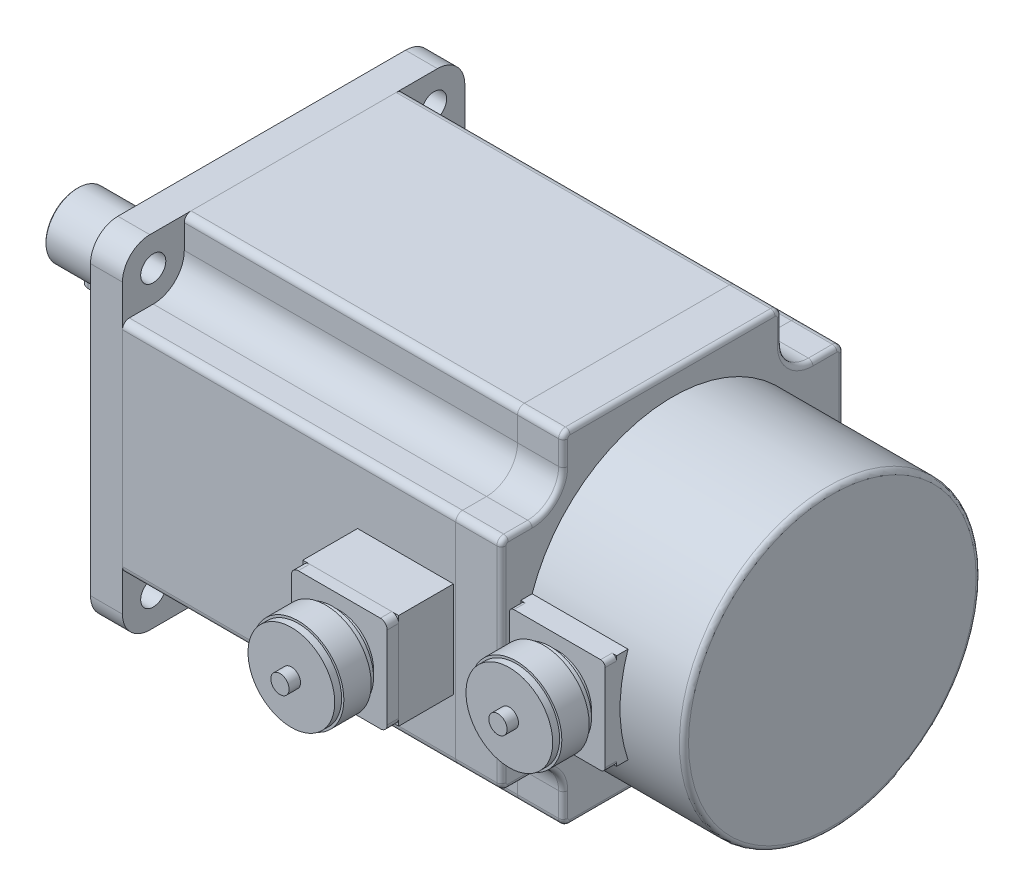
from build123d import *

# Parameters (mm, degrees)
EXTRUDE_1_DEPTH     = 20
EXTRUDE_2_DEPTH     = 146
EXTRUDE_3_DEPTH     = 14
SKETCH_4_W          = 42
SKETCH_4_H          = 42
EXTRUDE_4_DEPTH     = 24
EXTRUDE_5_DEPTH     = 5
SKETCH_6_R          = 15
EXTRUDE_6_DEPTH     = 3
SKETCH_7_R          = 18
EXTRUDE_7_DEPTH     = 3
SKETCH_8_R          = 20
EXTRUDE_8_DEPTH     = 12
SKETCH_9_R          = 19
EXTRUDE_9_DEPTH     = 3
SKETCH_10_R         = 4
EXTRUDE_10_DEPTH    = 5
CUT_EXTRUDE_START   = -166
CUT_EXTRUDE_2_DEPTH = 166
FILLET_1_R          = 2
SKETCH_12_R         = 5.5
CUT_EXTRUDE_3_DEPTH = 14
SKETCH_13_R         = 65
SKETCH_13_R_2       = 57.5
EXTRUDE_11_DEPTH    = 6
SKETCH_14_R         = 35
EXTRUDE_12_DEPTH    = 6
SKETCH_15_R         = 17.5
EXTRUDE_13_DEPTH    = 3
FILLET_2_R          = 0.5
SKETCH_16_R         = 14
EXTRUDE_14_DEPTH    = 72
CHAMFER_1_SIZE      = 0.5
SKETCH_19_R         = 65
EXTRUDE_16_DEPTH    = 70
FILLET_3_R          = 2
SKETCH_20_W         = 42
SKETCH_20_H         = 42
CUT_EXTRUDE_5_DEPTH = 10
SKETCH_21_W         = 42
SKETCH_21_H         = 42
EXTRUDE_17_DEPTH    = 11.5
EXTRUDE_18_DEPTH    = 5
SKETCH_23_R         = 15
EXTRUDE_19_DEPTH    = 3
SKETCH_24_R         = 18
EXTRUDE_20_DEPTH    = 3
SKETCH_25_R         = 20
EXTRUDE_21_DEPTH    = 12
SKETCH_26_R         = 19
EXTRUDE_22_DEPTH    = 3
SKETCH_27_R         = 4
EXTRUDE_23_DEPTH    = 5
CUT_EXTRUDE_6_DEPTH = 4
EXTRUDE_24_DEPTH    = 8


with BuildPart() as part:
    # Sketch 1 → Extrude 1 (new body)
    with BuildSketch(Plane(origin=(0, 0, 0), x_dir=(0, 0, -1), z_dir=(1, 0, 0))):
        with BuildLine():
            Line((-63, -75), (63, -75))
            ThreePointArc((63, -75), (71.485281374, -71.485281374), (75, -63))
            Line((75, -63), (75, 63))
            ThreePointArc((75, 63), (71.485281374, 71.485281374), (63, 75))
            Line((63, 75), (-63, 75))
            ThreePointArc((-63, 75), (-71.485281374, 71.485281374), (-75, 63))
            Line((-75, 63), (-75, -63))
            ThreePointArc((-75, -63), (-71.485281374, -71.485281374), (-63, -75))
        make_face()
    extrude(amount=EXTRUDE_1_DEPTH)


with BuildPart() as body_2:
    # Sketch 2 → Extrude 2 (new body)
    with BuildSketch(Plane.ZY):
        with BuildLine():
            Line((-63, -75), (63, -75))
            ThreePointArc((63, -75), (71.485281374, -71.485281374), (75, -63))
            Line((75, -63), (75, 63))
            ThreePointArc((75, 63), (71.485281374, 71.485281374), (63, 75))
            Line((63, 75), (-63, 75))
            ThreePointArc((-63, 75), (-71.485281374, 71.485281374), (-75, 63))
            Line((-75, 63), (-75, -63))
            ThreePointArc((-75, -63), (-71.485281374, -71.485281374), (-63, -75))
        make_face()
    extrude(amount=EXTRUDE_2_DEPTH)


with BuildPart() as body_3:
    # Sketch 3 → Extrude 3 (new body)
    with BuildSketch(Plane.ZY.offset(146)):
        with BuildLine():
            Line((-63, -75), (63, -75))
            ThreePointArc((63, -75), (71.485281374, -71.485281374), (75, -63))
            Line((75, -63), (75, 63))
            ThreePointArc((75, 63), (71.485281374, 71.485281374), (63, 75))
            Line((63, 75), (-63, 75))
            ThreePointArc((-63, 75), (-71.485281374, 71.485281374), (-75, 63))
            Line((-75, 63), (-75, -63))
            ThreePointArc((-75, -63), (-71.485281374, -71.485281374), (-63, -75))
        make_face()
    extrude(amount=EXTRUDE_3_DEPTH)

    # Sketch 12 → Cut-Extrude 3 (cut)
    with BuildSketch(Plane.ZY.offset(160)):
        with Locations((-61.518289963, 61.518289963)):
            Circle(SKETCH_12_R)
        with Locations((61.518289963, 61.518289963)):
            Circle(SKETCH_12_R)
        with Locations((-61.518289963, -61.518289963)):
            Circle(SKETCH_12_R)
        with Locations((61.518289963, -61.518289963)):
            Circle(SKETCH_12_R)
    extrude(amount=-CUT_EXTRUDE_3_DEPTH, mode=Mode.SUBTRACT)



with BuildPart() as body_4:
    # Sketch 4 → Extrude 4 (new body)
    with BuildSketch(Plane.XY.offset(75)):
        with Locations((-22, 0)):
            Rectangle(SKETCH_4_W, SKETCH_4_H)
    extrude(amount=EXTRUDE_4_DEPTH)


with BuildPart() as body_5:
    # Sketch 5 → Extrude 5 (new body)
    with BuildSketch(Plane.XY.offset(99)):
        with BuildLine():
            Line((-40, -21), (-4, -21))
            ThreePointArc((-4, -21), (-1.878679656, -20.121320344), (-1, -18))
            Line((-1, -18), (-1, 18))
            ThreePointArc((-1, 18), (-1.878679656, 20.121320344), (-4, 21))
            Line((-4, 21), (-40, 21))
            ThreePointArc((-40, 21), (-42.121320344, 20.121320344), (-43, 18))
            Line((-43, 18), (-43, -18))
            ThreePointArc((-43, -18), (-42.121320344, -20.121320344), (-40, -21))
        make_face()
    extrude(amount=EXTRUDE_5_DEPTH)


with BuildPart() as body_6:
    # Sketch 6 → Extrude 6 (new body)
    with BuildSketch(Plane.XY.offset(104)):
        with Locations((-22, 0)):
            Circle(SKETCH_6_R)
    extrude(amount=EXTRUDE_6_DEPTH)


with BuildPart() as body_7:
    # Sketch 7 → Extrude 7 (new body)
    with BuildSketch(Plane.XY.offset(107)):
        with Locations((-22, 0)):
            Circle(SKETCH_7_R)
    extrude(amount=EXTRUDE_7_DEPTH)


with BuildPart() as body_8:
    # Sketch 8 → Extrude 8 (new body)
    with BuildSketch(Plane.XY.offset(110)):
        with Locations((-22, 0)):
            Circle(SKETCH_8_R)
    extrude(amount=EXTRUDE_8_DEPTH)

    # Sketch 9 → Extrude 9 (add)
    with BuildSketch(Plane.XY.offset(122)):
        with Locations((-22, 0)):
            Circle(SKETCH_9_R)
    extrude(amount=EXTRUDE_9_DEPTH)

    # Sketch 10 → Extrude 10 (add)
    with BuildSketch(Plane.XY.offset(125)):
        with Locations((-22, 0)):
            Circle(SKETCH_10_R)
    extrude(amount=EXTRUDE_10_DEPTH)


with BuildPart() as cut_extrude_2_tool:
    # Sketch 11 → Cut-Extrude 2 (new body)
    with BuildSketch(Plane(origin=(20, 0, 0), x_dir=(0, 0, -1), z_dir=(1, 0, 0)).offset(CUT_EXTRUDE_START)):
        with BuildLine():
            Line((47.916922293, -61.5), (47.916922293, -72))
            ThreePointArc((47.916922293, -72), (47.038242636, -74.121320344), (44.916922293, -75))
            Line((44.916922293, -75), (63, -75))
            ThreePointArc((63, -75), (71.485281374, -71.485281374), (75, -63))
            Line((75, -63), (75, -44.916922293))
            ThreePointArc((75, -44.916922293), (74.121320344, -47.038242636), (72, -47.916922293))
            Line((72, -47.916922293), (61.5, -47.916922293))
            ThreePointArc((61.5, -47.916922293), (51.895313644, -51.895313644), (47.916922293, -61.5))
        make_face()
        with BuildLine():
            Line((-75, -44.916922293), (-75, -63))
            ThreePointArc((-75, -63), (-71.485281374, -71.485281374), (-63, -75))
            Line((-63, -75), (-44.916922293, -75))
            ThreePointArc((-44.916922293, -75), (-47.038242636, -74.121320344), (-47.916922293, -72))
            Line((-47.916922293, -72), (-47.916922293, -61.5))
            ThreePointArc((-47.916922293, -61.5), (-51.895313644, -51.895313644), (-61.5, -47.916922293))
            Line((-61.5, -47.916922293), (-72, -47.916922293))
            ThreePointArc((-72, -47.916922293), (-74.121320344, -47.038242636), (-75, -44.916922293))
        make_face()
        with BuildLine():
            Line((75, 63), (75, 44.916922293))
            ThreePointArc((75, 44.916922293), (74.121320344, 47.038242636), (72, 47.916922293))
            Line((72, 47.916922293), (61.5, 47.916922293))
            ThreePointArc((61.5, 47.916922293), (51.895313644, 51.895313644), (47.916922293, 61.5))
            Line((47.916922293, 61.5), (47.916922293, 72))
            ThreePointArc((47.916922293, 72), (47.038242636, 74.121320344), (44.916922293, 75))
            Line((44.916922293, 75), (63, 75))
            ThreePointArc((63, 75), (71.485281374, 71.485281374), (75, 63))
        make_face()
        with BuildLine():
            Line((-44.916922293, 75), (-63, 75))
            ThreePointArc((-63, 75), (-71.485281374, 71.485281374), (-75, 63))
            Line((-75, 63), (-75, 44.916922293))
            ThreePointArc((-75, 44.916922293), (-74.121320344, 47.038242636), (-72, 47.916922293))
            Line((-72, 47.916922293), (-61.5, 47.916922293))
            ThreePointArc((-61.5, 47.916922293), (-51.895313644, 51.895313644), (-47.916922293, 61.5))
            Line((-47.916922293, 61.5), (-47.916922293, 72))
            ThreePointArc((-47.916922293, 72), (-47.038242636, 74.121320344), (-44.916922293, 75))
        make_face()
    extrude(amount=CUT_EXTRUDE_2_DEPTH)


with BuildPart() as part_1:
    add(part.part)

    # Cut-Extrude 2: cut by cut_extrude_2_tool
    add(cut_extrude_2_tool.part, mode=Mode.SUBTRACT)

    # Fillet 1
    fillet_1_edges = [part_1.edges().sort_by_distance(p)[0] for p in [
        (20, 51.895313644, -51.895313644),
        (20, 47.916922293, -66.75),
        (20, 47.038242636, -74.121320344),
        (20, 74.121320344, -47.038242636),
        (20, 66.75, -47.916922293),
        (20, 0, -75),
        (20, 75, 0),
        (20, 0, 75),
        (20, -75, 0),
        (20, -47.038242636, 74.121320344),
        (20, -74.121320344, 47.038242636),
        (20, -66.75, 47.916922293),
        (20, -51.895313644, 51.895313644),
        (20, -47.916922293, 66.75),
        (20, -51.895313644, -51.895313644),
        (20, -66.75, -47.916922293),
        (20, -74.121320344, -47.038242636),
        (20, -47.038242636, -74.121320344),
        (20, -47.916922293, -66.75),
        (20, 47.038242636, 74.121320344),
        (20, 47.916922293, 66.75),
        (20, 51.895313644, 51.895313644),
        (20, 66.75, 47.916922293),
        (20, 74.121320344, 47.038242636),
    ]]
    fillet(fillet_1_edges, radius=FILLET_1_R)



with BuildPart() as body_2_1:
    add(body_2.part)

    # Cut-Extrude 2: cut by cut_extrude_2_tool
    add(cut_extrude_2_tool.part, mode=Mode.SUBTRACT)


with BuildPart() as body_9:
    # Sketch 13 → Extrude 11 (new body)
    with BuildSketch(Plane.ZY.offset(160)):
        Circle(SKETCH_13_R)
        Circle(SKETCH_13_R_2, mode=Mode.SUBTRACT)
    extrude(amount=EXTRUDE_11_DEPTH)


with BuildPart() as body_3_1:
    add(body_3.part)

    add(body_9.part)  # Extrude 12 merges body 9
    # Sketch 14 → Extrude 12 (add)
    with BuildSketch(Plane.ZY.offset(160)):
        with Locations(Location((0, 0, 0), (0, 0, 180))):
            Circle(SKETCH_14_R)
    extrude(amount=EXTRUDE_12_DEPTH)


with BuildPart() as body_9_2:
    # Sketch 15 → Extrude 13 (new body)
    with BuildSketch(Plane.ZY.offset(166)):
        Circle(SKETCH_15_R)
    extrude(amount=EXTRUDE_13_DEPTH)

    # Fillet 2
    fillet_2_edges = [body_9_2.edges().sort_by_distance(p)[0] for p in [
        (-169, 0, -17.5),
    ]]
    fillet(fillet_2_edges, radius=FILLET_2_R)

    # Sketch 16 → Extrude 14 (add)
    with BuildSketch(Plane.ZY.offset(169)):
        Circle(SKETCH_16_R)
    extrude(amount=EXTRUDE_14_DEPTH)

    # Chamfer 1
    chamfer_1_edges = [body_9_2.edges().sort_by_distance(p)[0] for p in [
        (-241, 0, -14),
    ]]
    chamfer(chamfer_1_edges, length=CHAMFER_1_SIZE)

    # Sketch 29 → Cut-Extrude 6 (cut)
    with BuildSketch(Plane(origin=(0, -14, 0), x_dir=(1, 0, 0), z_dir=(0, 1, 0))):
        with BuildLine():
            Line((-232, -4), (-185, -4))
            ThreePointArc((-185, -4), (-181, 0), (-185, 4))
            Line((-185, 4), (-232, 4))
            ThreePointArc((-232, 4), (-236, 0), (-232, -4))
        make_face()
    extrude(amount=CUT_EXTRUDE_6_DEPTH, mode=Mode.SUBTRACT)


with BuildPart() as body_10:
    # Sketch 19 → Extrude 16 (new body)
    with BuildSketch(Plane(origin=(20, 0, 0), x_dir=(0, 0, -1), z_dir=(1, 0, 0))):
        Circle(SKETCH_19_R)
    extrude(amount=EXTRUDE_16_DEPTH)

    # Fillet 3
    fillet_3_edges = [body_10.edges().sort_by_distance(p)[0] for p in [
        (90, 0, 65),
    ]]
    fillet(fillet_3_edges, radius=FILLET_3_R)

    # Sketch 20 → Cut-Extrude 5 (cut)
    with BuildSketch(Plane.XY.offset(65)):
        with Locations((41, 0)):
            Rectangle(SKETCH_20_W, SKETCH_20_H)
    extrude(amount=-CUT_EXTRUDE_5_DEPTH, mode=Mode.SUBTRACT)


with BuildPart() as part_2:
    add(part_1.part)

    add(body_10.part)  # Extrude 17 merges body 10
    # Sketch 21 → Extrude 17 (add)
    with BuildSketch(Plane.XY.offset(55)):
        with Locations((41, 0)):
            Rectangle(SKETCH_21_W, SKETCH_21_H)
    extrude(amount=EXTRUDE_17_DEPTH)



with BuildPart() as body_10_2:
    # Sketch 22 → Extrude 18 (new body)
    with BuildSketch(Plane.XY.offset(66.5)):
        with BuildLine():
            Line((22, -21), (60, -21))
            ThreePointArc((60, -21), (61.414213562, -20.414213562), (62, -19))
            Line((62, -19), (62, 19))
            ThreePointArc((62, 19), (61.414213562, 20.414213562), (60, 21))
            Line((60, 21), (22, 21))
            ThreePointArc((22, 21), (20.585786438, 20.414213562), (20, 19))
            Line((20, 19), (20, -19))
            ThreePointArc((20, -19), (20.585786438, -20.414213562), (22, -21))
        make_face()
    extrude(amount=EXTRUDE_18_DEPTH)


with BuildPart() as part_3:
    add(part_2.part)

    add(body_10_2.part)  # Extrude 19 merges body 10 2
    # Sketch 23 → Extrude 19 (add)
    with BuildSketch(Plane.XY.offset(71.5)):
        with Locations(Location((41, 0, 0), (0, 0, 180))):
            Circle(SKETCH_23_R)
    extrude(amount=EXTRUDE_19_DEPTH)

    # Sketch 24 → Extrude 20 (add)
    with BuildSketch(Plane.XY.offset(74.5)):
        with Locations((41, 0)):
            Circle(SKETCH_24_R)
    extrude(amount=EXTRUDE_20_DEPTH)

    # Sketch 25 → Extrude 21 (add)
    with BuildSketch(Plane.XY.offset(77.5)):
        with Locations((41, 0)):
            Circle(SKETCH_25_R)
    extrude(amount=EXTRUDE_21_DEPTH)

    # Sketch 26 → Extrude 22 (add)
    with BuildSketch(Plane.XY.offset(89.5)):
        with Locations((41, 0)):
            Circle(SKETCH_26_R)
    extrude(amount=EXTRUDE_22_DEPTH)

    # Sketch 27 → Extrude 23 (add)
    with BuildSketch(Plane.XY.offset(92.5)):
        with Locations((41, 0)):
            Circle(SKETCH_27_R)
    extrude(amount=EXTRUDE_23_DEPTH)


with BuildPart() as body_10_3:
    # Sketch 30 → Extrude 24 (new body)
    with BuildSketch(Plane.XZ.offset(10)):
        with BuildLine():
            Line((-232, 4), (-185, 4))
            ThreePointArc((-185, 4), (-181, 0), (-185, -4))
            Line((-185, -4), (-232, -4))
            ThreePointArc((-232, -4), (-236, 0), (-232, 4))
        make_face()
    extrude(amount=EXTRUDE_24_DEPTH)


solid = Compound([body_4.part, body_5.part, body_6.part, body_7.part, body_8.part, body_2_1.part, body_3_1.part, body_9_2.part, part_3.part, body_10_3.part])
